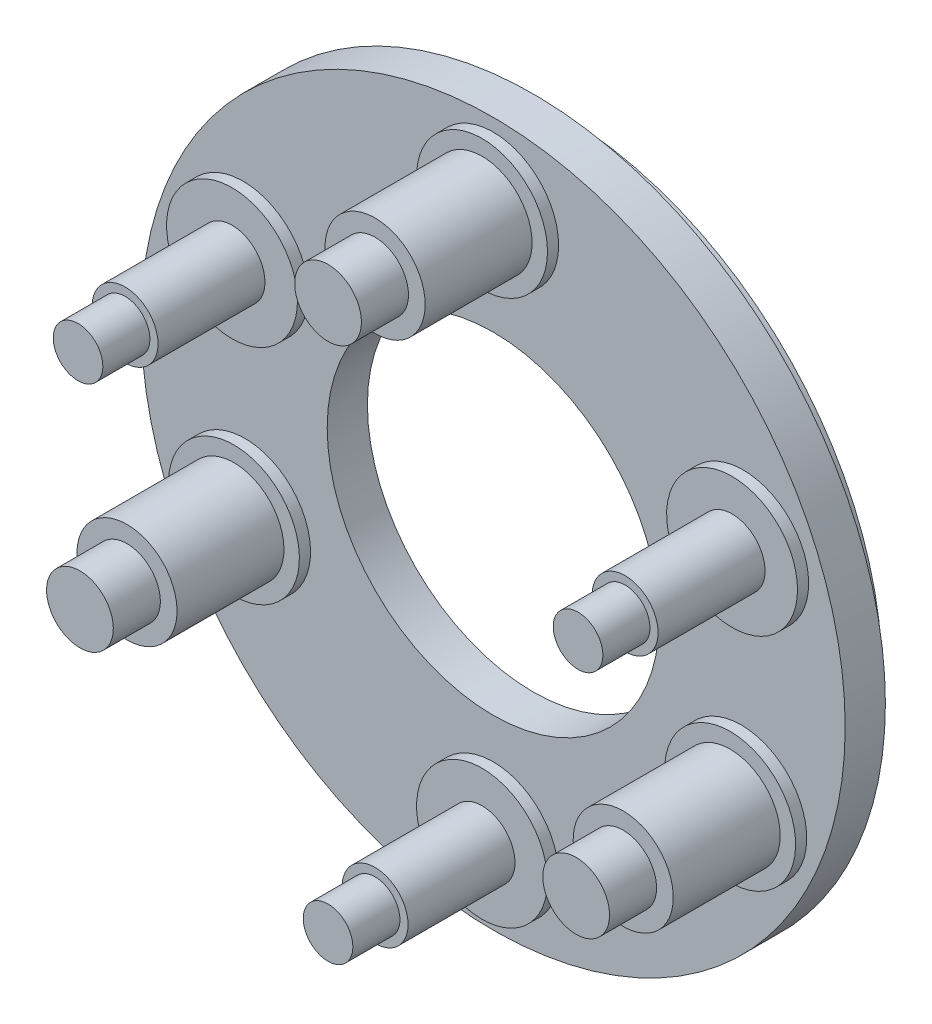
from build123d import *

# Parameters (mm, degrees)
SKETCH1_R                        = 10.4521
SKETCH1_R_2                      = 4.9276
BASE_DEPTH                       = 1.1938
SKETCH2_R                        = 9.6393
SKETCH2_R_2                      = 8.89
TRACK_DEPTH                      = 0.7112
SKETCH3_R                        = 1.9431
PLATFORM_A1_DEPTH                = 0.3302
SKETCH4_R                        = 1.4859
PLATFORM_A2_DEPTH                = 3.175
SKETCH5_R                        = 0.9906
PLATFORM_A3_DEPTH                = 1.397
CCW_PATTERN_FOR_PLATFORM_A_COUNT = 2
CCW_PATTERN_FOR_PLATFORM_A_ANGLE = 115
CW_PATTERN_FOR_PLATFORM_A_COUNT  = 2
CW_PATTERN_FOR_PLATFORM_A_ANGLE  = 115
SKETCH6_R                        = 1.9431
PLATFORM_B1_DEPTH                = 0.3302
SKETCH7_R                        = 0.9779
PLATFORM_B2_DEPTH                = 3.175
SKETCH8_R                        = 0.7366
PLATFORM_B3_DEPTH                = 1.397
CCW_PATTERN_FOR_PLATFORM_B_COUNT = 2
CCW_PATTERN_FOR_PLATFORM_B_ANGLE = 113
CW_PATTERN_FOR_PLATFORM_B_COUNT  = 2
CW_PATTERN_FOR_PLATFORM_B_ANGLE  = 113


with BuildPart() as part:
    # Sketch1 → Base (new body)
    with BuildSketch(Plane.XY):
        Circle(SKETCH1_R)
        Circle(SKETCH1_R_2, mode=Mode.SUBTRACT)
    extrude(amount=BASE_DEPTH)

    # Sketch2 → Track (add)
    with BuildSketch(Plane(origin=(0, 0, 0), x_dir=(-1, 0, 0), z_dir=(0, 0, -1))):
        with Locations(Location((0, 0, 0), (0, 0, 180))):
            Circle(SKETCH2_R)
        Circle(SKETCH2_R_2, mode=Mode.SUBTRACT)
    extrude(amount=TRACK_DEPTH)

    # Sketch3 → Platform A1 (add)
    with BuildSketch(Plane.XY.offset(1.1938)):
        with Locations((0, 8.128)):
            Circle(SKETCH3_R)
    platform_a1 = extrude(amount=PLATFORM_A1_DEPTH)

    # Sketch4 → Platform A2 (add)
    with BuildSketch(Plane.XY.offset(1.524)):
        with Locations((0, 8.128)):
            Circle(SKETCH4_R)
    platform_a2 = extrude(amount=PLATFORM_A2_DEPTH)

    # Sketch5 → Platform A3 (add)
    with BuildSketch(Plane.XY.offset(4.699)):
        with Locations((0, 8.128)):
            Circle(SKETCH5_R)
    platform_a3 = extrude(amount=PLATFORM_A3_DEPTH)

    # CCW pattern for platform A: Platform A1, Platform A2, Platform A3 ×2 about axis
    ccw_pattern_for_platform_a_axis = Axis((0, 0, 1.1938), (0, 0, 1))
    add([platform_a1.rotate(ccw_pattern_for_platform_a_axis, i * CCW_PATTERN_FOR_PLATFORM_A_ANGLE / (CCW_PATTERN_FOR_PLATFORM_A_COUNT - 1)) for i in range(1, CCW_PATTERN_FOR_PLATFORM_A_COUNT)])
    add([platform_a2.rotate(ccw_pattern_for_platform_a_axis, i * CCW_PATTERN_FOR_PLATFORM_A_ANGLE / (CCW_PATTERN_FOR_PLATFORM_A_COUNT - 1)) for i in range(1, CCW_PATTERN_FOR_PLATFORM_A_COUNT)])
    add([platform_a3.rotate(ccw_pattern_for_platform_a_axis, i * CCW_PATTERN_FOR_PLATFORM_A_ANGLE / (CCW_PATTERN_FOR_PLATFORM_A_COUNT - 1)) for i in range(1, CCW_PATTERN_FOR_PLATFORM_A_COUNT)])

    # CW pattern for platform A: Platform A1, Platform A2, Platform A3 ×2 about axis
    cw_pattern_for_platform_a_axis = Axis((0, 0, 1.1938), (0, 0, -1))
    add([platform_a1.rotate(cw_pattern_for_platform_a_axis, i * CW_PATTERN_FOR_PLATFORM_A_ANGLE / (CW_PATTERN_FOR_PLATFORM_A_COUNT - 1)) for i in range(1, CW_PATTERN_FOR_PLATFORM_A_COUNT)])
    add([platform_a2.rotate(cw_pattern_for_platform_a_axis, i * CW_PATTERN_FOR_PLATFORM_A_ANGLE / (CW_PATTERN_FOR_PLATFORM_A_COUNT - 1)) for i in range(1, CW_PATTERN_FOR_PLATFORM_A_COUNT)])
    add([platform_a3.rotate(cw_pattern_for_platform_a_axis, i * CW_PATTERN_FOR_PLATFORM_A_ANGLE / (CW_PATTERN_FOR_PLATFORM_A_COUNT - 1)) for i in range(1, CW_PATTERN_FOR_PLATFORM_A_COUNT)])

    # Sketch6 → Platform B1 (add)
    with BuildSketch(Plane.XY.offset(1.1938)):
        with Locations((0, -8.0645)):
            Circle(SKETCH6_R)
    platform_b1 = extrude(amount=PLATFORM_B1_DEPTH)

    # Sketch7 → Platform B2 (add)
    with BuildSketch(Plane.XY.offset(1.524)):
        with Locations((0, -8.0645)):
            Circle(SKETCH7_R)
    platform_b2 = extrude(amount=PLATFORM_B2_DEPTH)

    # Sketch8 → Platform B3 (add)
    with BuildSketch(Plane.XY.offset(4.699)):
        with Locations((0, -8.0645)):
            Circle(SKETCH8_R)
    platform_b3 = extrude(amount=PLATFORM_B3_DEPTH)

    # CCW pattern for platform B: Platform B1, Platform B2, Platform B3 ×2 about axis
    ccw_pattern_for_platform_b_axis = Axis((0, 0, 1.1938), (0, 0, 1))
    add([platform_b1.rotate(ccw_pattern_for_platform_b_axis, i * CCW_PATTERN_FOR_PLATFORM_B_ANGLE / (CCW_PATTERN_FOR_PLATFORM_B_COUNT - 1)) for i in range(1, CCW_PATTERN_FOR_PLATFORM_B_COUNT)])
    add([platform_b2.rotate(ccw_pattern_for_platform_b_axis, i * CCW_PATTERN_FOR_PLATFORM_B_ANGLE / (CCW_PATTERN_FOR_PLATFORM_B_COUNT - 1)) for i in range(1, CCW_PATTERN_FOR_PLATFORM_B_COUNT)])
    add([platform_b3.rotate(ccw_pattern_for_platform_b_axis, i * CCW_PATTERN_FOR_PLATFORM_B_ANGLE / (CCW_PATTERN_FOR_PLATFORM_B_COUNT - 1)) for i in range(1, CCW_PATTERN_FOR_PLATFORM_B_COUNT)])

    # CW pattern for platform B: Platform B1, Platform B2, Platform B3 ×2 about axis
    cw_pattern_for_platform_b_axis = Axis((0, 0, 1.1938), (0, 0, -1))
    add([platform_b1.rotate(cw_pattern_for_platform_b_axis, i * CW_PATTERN_FOR_PLATFORM_B_ANGLE / (CW_PATTERN_FOR_PLATFORM_B_COUNT - 1)) for i in range(1, CW_PATTERN_FOR_PLATFORM_B_COUNT)])
    add([platform_b2.rotate(cw_pattern_for_platform_b_axis, i * CW_PATTERN_FOR_PLATFORM_B_ANGLE / (CW_PATTERN_FOR_PLATFORM_B_COUNT - 1)) for i in range(1, CW_PATTERN_FOR_PLATFORM_B_COUNT)])
    add([platform_b3.rotate(cw_pattern_for_platform_b_axis, i * CW_PATTERN_FOR_PLATFORM_B_ANGLE / (CW_PATTERN_FOR_PLATFORM_B_COUNT - 1)) for i in range(1, CW_PATTERN_FOR_PLATFORM_B_COUNT)])


solid = part.part
